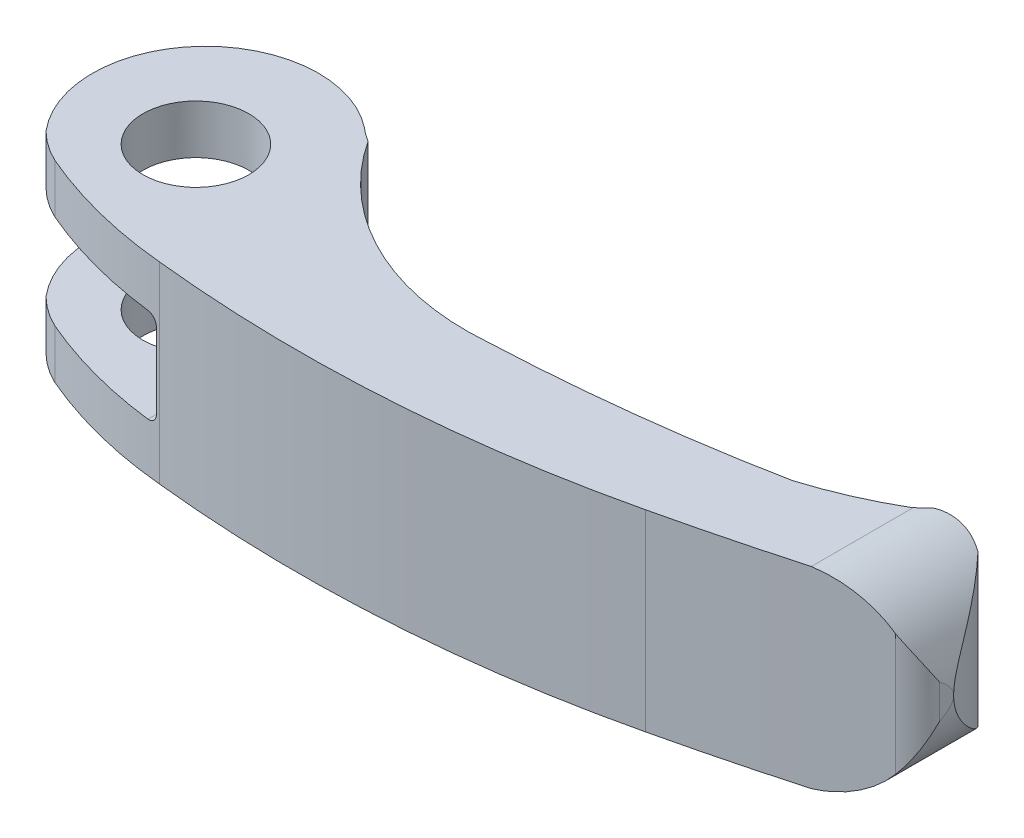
ISO-10303-21;
HEADER;
FILE_DESCRIPTION(('STEP AP214'),'2;1');
FILE_NAME('part.step','',(''),(''),'','','');
FILE_SCHEMA(('AUTOMOTIVE_DESIGN { 1 0 10303 214 1 1 1 1 }'));
ENDSEC;
DATA;
#1=APPLICATION_CONTEXT('core data for automotive mechanical design processes');
#2=APPLICATION_PROTOCOL_DEFINITION('international standard','automotive_design',2000,#1);
#3=PRODUCT_CONTEXT('',#1,'mechanical');
#4=PRODUCT('Part','Part','',(#3));
#5=PRODUCT_RELATED_PRODUCT_CATEGORY('part','',(#4));
#6=PRODUCT_DEFINITION_FORMATION('','',#4);
#7=PRODUCT_DEFINITION_CONTEXT('part definition',#1,'design');
#8=PRODUCT_DEFINITION('design','',#6,#7);
#9=PRODUCT_DEFINITION_SHAPE('','',#8);
#10=(LENGTH_UNIT() NAMED_UNIT(*) SI_UNIT(.MILLI.,.METRE.));
#11=(NAMED_UNIT(*) PLANE_ANGLE_UNIT() SI_UNIT($,.RADIAN.));
#12=(NAMED_UNIT(*) SI_UNIT($,.STERADIAN.) SOLID_ANGLE_UNIT());
#13=UNCERTAINTY_MEASURE_WITH_UNIT(LENGTH_MEASURE(1.E-05),#10,'distance_accuracy_value','');
#14=(GEOMETRIC_REPRESENTATION_CONTEXT(3) GLOBAL_UNCERTAINTY_ASSIGNED_CONTEXT((#13)) GLOBAL_UNIT_ASSIGNED_CONTEXT((#10,
#11,#12)) REPRESENTATION_CONTEXT('',''));
#15=CARTESIAN_POINT('',(0.,0.,0.));
#16=DIRECTION('',(0.,0.,1.));
#17=DIRECTION('',(1.,0.,0.));
#18=AXIS2_PLACEMENT_3D('',#15,#16,#17);
#19=CARTESIAN_POINT('',(-1.25725046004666,-10.,-1.08149572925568));
#20=DIRECTION('',(0.,-1.,0.));
#21=DIRECTION('',(1.,0.,0.));
#22=AXIS2_PLACEMENT_3D('',#19,#20,#21);
#23=PLANE('',#22);
#24=CARTESIAN_POINT('',(24.778083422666,-10.,-187.016828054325));
#25=DIRECTION('',(0.,1.,0.));
#26=DIRECTION('',(1.,0.,0.));
#27=AXIS2_PLACEMENT_3D('',#24,#25,#26);
#28=CIRCLE('',#27,189.839626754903);
#29=CARTESIAN_POINT('',(33.014911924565,-10.,2.6440233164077));
#30=VERTEX_POINT('',#29);
#31=CARTESIAN_POINT('',(61.231882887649,-10.,-0.710079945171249));
#32=VERTEX_POINT('',#31);
#33=EDGE_CURVE('E335',#30,#32,#28,.T.);
#34=ORIENTED_EDGE('',*,*,#33,.T.);
#35=CARTESIAN_POINT('',(49.221459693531,-10.,-40.1661322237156));
#36=DIRECTION('',(0.,1.,0.));
#37=DIRECTION('',(1.,0.,0.));
#38=AXIS2_PLACEMENT_3D('',#35,#36,#37);
#39=CIRCLE('',#38,41.2435489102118);
#40=CARTESIAN_POINT('',(69.968173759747,-10.,-4.52059698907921));
#41=VERTEX_POINT('',#40);
#42=EDGE_CURVE('E337',#32,#41,#39,.T.);
#43=ORIENTED_EDGE('',*,*,#42,.T.);
#44=CARTESIAN_POINT('',(61.6418152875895,-10.,-12.1051867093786));
#45=DIRECTION('',(0.,1.,0.));
#46=DIRECTION('',(1.,0.,0.));
#47=AXIS2_PLACEMENT_3D('',#44,#45,#46);
#48=CIRCLE('',#47,11.2629590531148);
#49=CARTESIAN_POINT('',(70.,-10.,-4.55568374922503));
#50=VERTEX_POINT('',#49);
#51=EDGE_CURVE('E340',#41,#50,#48,.T.);
#52=ORIENTED_EDGE('',*,*,#51,.T.);
#53=DIRECTION('',(0.,0.,-1.));
#54=VECTOR('',#53,1.);
#55=CARTESIAN_POINT('',(70.,-10.,19.75));
#56=LINE('',#55,#54);
#57=CARTESIAN_POINT('',(70.,-10.,6.02646126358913));
#58=VERTEX_POINT('',#57);
#59=EDGE_CURVE('E267',#58,#50,#56,.T.);
#60=ORIENTED_EDGE('',*,*,#59,.F.);
#61=CARTESIAN_POINT('',(-10.9776441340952,-10.,-281.701493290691));
#62=DIRECTION('',(0.,-1.,0.));
#63=DIRECTION('',(1.,0.,0.));
#64=AXIS2_PLACEMENT_3D('',#61,#62,#63);
#65=CIRCLE('',#64,298.905929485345);
#66=CARTESIAN_POINT('',(56.261559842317,-10.,9.54349658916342));
#67=VERTEX_POINT('',#66);
#68=EDGE_CURVE('E343',#58,#67,#65,.T.);
#69=ORIENTED_EDGE('',*,*,#68,.T.);
#70=CARTESIAN_POINT('',(23.8400067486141,-10.,-128.584744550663));
#71=DIRECTION('',(0.,-1.,0.));
#72=DIRECTION('',(1.,0.,0.));
#73=AXIS2_PLACEMENT_3D('',#70,#71,#72);
#74=CIRCLE('',#73,141.882233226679);
#75=CARTESIAN_POINT('',(8.7252072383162,-10.,12.49009708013));
#76=VERTEX_POINT('',#75);
#77=EDGE_CURVE('E345',#67,#76,#74,.T.);
#78=ORIENTED_EDGE('',*,*,#77,.T.);
#79=CARTESIAN_POINT('',(13.0857239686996,-10.,-35.3114289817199));
#80=DIRECTION('',(0.,-1.,0.));
#81=DIRECTION('',(1.,0.,0.));
#82=AXIS2_PLACEMENT_3D('',#79,#80,#81);
#83=CIRCLE('',#82,47.9999999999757);
#84=CARTESIAN_POINT('',(-5.8635593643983,-10.,8.78987101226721));
#85=VERTEX_POINT('',#84);
#86=EDGE_CURVE('E348',#76,#85,#83,.T.);
#87=ORIENTED_EDGE('',*,*,#86,.T.);
#88=CARTESIAN_POINT('',(-1.25725046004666,-10.,-1.08149572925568));
#89=DIRECTION('',(0.,-1.,0.));
#90=DIRECTION('',(1.,0.,0.));
#91=AXIS2_PLACEMENT_3D('',#88,#89,#90);
#92=CIRCLE('',#91,10.8932071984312);
#93=CARTESIAN_POINT('',(-8.9584461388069,-10.,6.6226296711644));
#94=VERTEX_POINT('',#93);
#95=EDGE_CURVE('E327',#85,#94,#92,.T.);
#96=ORIENTED_EDGE('',*,*,#95,.T.);
#97=CARTESIAN_POINT('',(0.000156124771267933,-10.,-0.999995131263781));
#98=DIRECTION('',(0.,-1.,0.));
#99=DIRECTION('',(1.,0.,0.));
#100=AXIS2_PLACEMENT_3D('',#97,#98,#99);
#101=CIRCLE('',#100,11.7626937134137);
#102=CARTESIAN_POINT('',(7.3025628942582,-10.,-10.221481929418));
#103=VERTEX_POINT('',#102);
#104=EDGE_CURVE('E328',#94,#103,#101,.T.);
#105=ORIENTED_EDGE('',*,*,#104,.T.);
#106=CARTESIAN_POINT('',(13.8867058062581,-10.,-17.8022650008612));
#107=DIRECTION('',(0.,1.,0.));
#108=DIRECTION('',(1.,0.,0.));
#109=AXIS2_PLACEMENT_3D('',#106,#107,#108);
#110=CIRCLE('',#109,10.0408769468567);
#111=CARTESIAN_POINT('',(8.68441948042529,-10.,-9.21416702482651));
#112=VERTEX_POINT('',#111);
#113=EDGE_CURVE('E330',#103,#112,#110,.T.);
#114=ORIENTED_EDGE('',*,*,#113,.T.);
#115=CARTESIAN_POINT('',(30.8065587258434,-10.,-23.714505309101));
#116=DIRECTION('',(0.,1.,0.));
#117=DIRECTION('',(1.,0.,0.));
#118=AXIS2_PLACEMENT_3D('',#115,#116,#117);
#119=CIRCLE('',#118,26.4508762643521);
#120=EDGE_CURVE('E333',#112,#30,#119,.T.);
#121=ORIENTED_EDGE('',*,*,#120,.T.);
#122=EDGE_LOOP('',(#34,#43,#52,#60,#69,#78,#87,#96,#105,#114,#121));
#123=FACE_BOUND('',#122,.T.);
#124=CARTESIAN_POINT('',(0.,-10.,0.));
#125=DIRECTION('',(0.,-1.,0.));
#126=DIRECTION('',(1.,0.,0.));
#127=AXIS2_PLACEMENT_3D('',#124,#125,#126);
#128=CIRCLE('',#127,5.5);
#129=CARTESIAN_POINT('',(5.5,-10.,0.));
#130=VERTEX_POINT('',#129);
#131=EDGE_CURVE('E446',#130,#130,#128,.F.);
#132=ORIENTED_EDGE('',*,*,#131,.T.);
#133=EDGE_LOOP('',(#132));
#134=FACE_BOUND('',#133,.T.);
#135=ADVANCED_FACE('F14',(#123,#134),#23,.T.);
#136=CARTESIAN_POINT('',(7.36,-4.9,19.75));
#137=DIRECTION('',(0.,-1.,0.));
#138=DIRECTION('',(1.,0.,0.));
#139=AXIS2_PLACEMENT_3D('',#136,#137,#138);
#140=PLANE('',#139);
#141=CARTESIAN_POINT('',(0.000156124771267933,-4.9,-0.999995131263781));
#142=DIRECTION('',(0.,-1.,0.));
#143=DIRECTION('',(1.,0.,0.));
#144=AXIS2_PLACEMENT_3D('',#141,#142,#143);
#145=CIRCLE('',#144,11.7626937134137);
#146=CARTESIAN_POINT('',(7.30256289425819,-4.9,-10.221481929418));
#147=VERTEX_POINT('',#146);
#148=CARTESIAN_POINT('',(-8.9584461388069,-4.9,6.6226296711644));
#149=VERTEX_POINT('',#148);
#150=EDGE_CURVE('E325',#147,#149,#145,.F.);
#151=ORIENTED_EDGE('',*,*,#150,.T.);
#152=CARTESIAN_POINT('',(-1.25725046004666,-4.9,-1.08149572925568));
#153=DIRECTION('',(0.,-1.,0.));
#154=DIRECTION('',(1.,0.,0.));
#155=AXIS2_PLACEMENT_3D('',#152,#153,#154);
#156=CIRCLE('',#155,10.8932071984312);
#157=CARTESIAN_POINT('',(-5.8635593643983,-4.9,8.7898710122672));
#158=VERTEX_POINT('',#157);
#159=EDGE_CURVE('E323',#149,#158,#156,.F.);
#160=ORIENTED_EDGE('',*,*,#159,.T.);
#161=CARTESIAN_POINT('',(13.0857239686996,-4.9,-35.3114289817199));
#162=DIRECTION('',(0.,-1.,0.));
#163=DIRECTION('',(1.,0.,0.));
#164=AXIS2_PLACEMENT_3D('',#161,#162,#163);
#165=CIRCLE('',#164,47.9999999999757);
#166=CARTESIAN_POINT('',(7.36,-4.9,12.3458483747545));
#167=VERTEX_POINT('',#166);
#168=EDGE_CURVE('E9',#158,#167,#165,.F.);
#169=ORIENTED_EDGE('',*,*,#168,.T.);
#170=DIRECTION('',(0.,0.,-1.));
#171=VECTOR('',#170,1.);
#172=CARTESIAN_POINT('',(7.36,-4.9,19.75));
#173=LINE('',#172,#171);
#174=CARTESIAN_POINT('',(7.36,-4.9,-10.1719752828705));
#175=VERTEX_POINT('',#174);
#176=EDGE_CURVE('E273',#167,#175,#173,.T.);
#177=ORIENTED_EDGE('',*,*,#176,.T.);
#178=CARTESIAN_POINT('',(13.8867058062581,-4.9,-17.8022650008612));
#179=DIRECTION('',(0.,1.,0.));
#180=DIRECTION('',(-1.,0.,0.));
#181=AXIS2_PLACEMENT_3D('',#178,#179,#180);
#182=CIRCLE('',#181,10.0408769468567);
#183=EDGE_CURVE('E222',#147,#175,#182,.T.);
#184=ORIENTED_EDGE('',*,*,#183,.F.);
#185=EDGE_LOOP('',(#151,#160,#169,#177,#184));
#186=FACE_BOUND('',#185,.T.);
#187=CARTESIAN_POINT('',(0.,-4.9,0.));
#188=DIRECTION('',(0.,-1.,0.));
#189=DIRECTION('',(1.,0.,0.));
#190=AXIS2_PLACEMENT_3D('',#187,#188,#189);
#191=CIRCLE('',#190,5.5);
#192=CARTESIAN_POINT('',(5.5,-4.9,0.));
#193=VERTEX_POINT('',#192);
#194=EDGE_CURVE('E18',#193,#193,#191,.F.);
#195=ORIENTED_EDGE('',*,*,#194,.F.);
#196=EDGE_LOOP('',(#195));
#197=FACE_BOUND('',#196,.T.);
#198=ADVANCED_FACE('F438',(#186,#197),#140,.F.);
#199=CARTESIAN_POINT('',(61.2713887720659,10.,6.56919871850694));
#200=DIRECTION('',(0.,-1.,0.));
#201=DIRECTION('',(1.,0.,0.));
#202=AXIS2_PLACEMENT_3D('',#199,#200,#201);
#203=CYLINDRICAL_SURFACE('',#202,18.8265226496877);
#204=DIRECTION('',(0.,-1.,0.));
#205=VECTOR('',#204,1.);
#206=CARTESIAN_POINT('',(75.209294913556,10.,-6.0867377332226));
#207=LINE('',#206,#205);
#208=CARTESIAN_POINT('',(75.209294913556,7.86548448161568,-6.0867377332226));
#209=VERTEX_POINT('',#208);
#210=CARTESIAN_POINT('',(75.209294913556,-7.86548448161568,-6.0867377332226));
#211=VERTEX_POINT('',#210);
#212=EDGE_CURVE('E390',#209,#211,#207,.T.);
#213=ORIENTED_EDGE('',*,*,#212,.F.);
#214=CARTESIAN_POINT('',(75.209294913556,-7.86548448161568,-6.0867377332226));
#215=CARTESIAN_POINT('',(75.3343879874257,-7.76584092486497,-5.9489731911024));
#216=CARTESIAN_POINT('',(75.456518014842,-7.66369469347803,-5.81036775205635));
#217=CARTESIAN_POINT('',(75.6949069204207,-7.45457001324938,-5.53178044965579));
#218=CARTESIAN_POINT('',(75.8111662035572,-7.34759189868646,-5.39179868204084));
#219=CARTESIAN_POINT('',(76.1513076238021,-7.01958843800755,-4.97014128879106));
#220=CARTESIAN_POINT('',(76.3664850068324,-6.79154863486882,-4.68682921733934));
#221=CARTESIAN_POINT('',(76.7763168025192,-6.31474548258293,-4.11538302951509));
#222=CARTESIAN_POINT('',(76.9706958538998,-6.06576741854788,-3.82723170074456));
#223=CARTESIAN_POINT('',(77.3361815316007,-5.54915590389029,-3.2530202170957));
#224=CARTESIAN_POINT('',(77.5072965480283,-5.28152923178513,-2.96695934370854));
#225=CARTESIAN_POINT('',(77.7651966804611,-4.83193684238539,-2.51003469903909));
#226=CARTESIAN_POINT('',(77.8592100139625,-4.65634278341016,-2.33694444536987));
#227=CARTESIAN_POINT('',(78.0381980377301,-4.29631200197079,-1.99521746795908));
#228=CARTESIAN_POINT('',(78.1231711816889,-4.11187377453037,-1.8265815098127));
#229=CARTESIAN_POINT('',(78.2834995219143,-3.73341442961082,-1.49675124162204));
#230=CARTESIAN_POINT('',(78.3588813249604,-3.53942198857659,-1.33553717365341));
#231=CARTESIAN_POINT('',(78.4996408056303,-3.13963519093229,-1.02385535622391));
#232=CARTESIAN_POINT('',(78.5650253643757,-2.93384908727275,-0.873380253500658));
#233=CARTESIAN_POINT('',(78.6864531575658,-2.50186222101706,-0.584725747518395));
#234=CARTESIAN_POINT('',(78.7421743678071,-2.27524501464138,-0.447023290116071));
#235=CARTESIAN_POINT('',(78.8396641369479,-1.80452538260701,-0.19920938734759));
#236=CARTESIAN_POINT('',(78.8814620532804,-1.56046108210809,-0.0890400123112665));
#237=CARTESIAN_POINT('',(78.9402400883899,-1.11220817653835,0.0688017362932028));
#238=CARTESIAN_POINT('',(78.9607017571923,-0.911565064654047,0.124987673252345));
#239=CARTESIAN_POINT('',(78.9894899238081,-0.50297405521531,0.204551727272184));
#240=CARTESIAN_POINT('',(78.9978326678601,-0.295036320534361,0.227973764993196));
#241=CARTESIAN_POINT('',(79.0014298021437,0.122800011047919,0.238032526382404));
#242=CARTESIAN_POINT('',(78.9966247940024,0.332703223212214,0.224502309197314));
#243=CARTESIAN_POINT('',(78.9743994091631,0.746477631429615,0.162771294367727));
#244=CARTESIAN_POINT('',(78.9569805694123,0.950349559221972,0.114574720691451));
#245=CARTESIAN_POINT('',(78.9280233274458,1.20218687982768,0.0360893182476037));
#246=CARTESIAN_POINT('',(78.9215088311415,1.25507304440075,0.0185033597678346));
#247=CARTESIAN_POINT('',(78.8876038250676,1.51355762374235,-0.0725559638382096));
#248=CARTESIAN_POINT('',(78.8548217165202,1.7139547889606,-0.159217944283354));
#249=CARTESIAN_POINT('',(78.7796222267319,2.1030920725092,-0.352541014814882));
#250=CARTESIAN_POINT('',(78.7371804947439,2.29180117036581,-0.459252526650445));
#251=CARTESIAN_POINT('',(78.6435678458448,2.66039107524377,-0.687573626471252));
#252=CARTESIAN_POINT('',(78.592311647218,2.84016113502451,-0.809325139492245));
#253=CARTESIAN_POINT('',(78.4823180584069,3.1901074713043,-1.06237424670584));
#254=CARTESIAN_POINT('',(78.4235865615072,3.36029115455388,-1.19366428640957));
#255=CARTESIAN_POINT('',(78.3023668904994,3.68398843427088,-1.45598317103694));
#256=CARTESIAN_POINT('',(78.2402293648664,3.83790904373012,-1.58667534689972));
#257=CARTESIAN_POINT('',(78.1099518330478,4.13940105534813,-1.85236002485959));
#258=CARTESIAN_POINT('',(78.0418105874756,4.28697113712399,-1.9873534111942));
#259=CARTESIAN_POINT('',(77.899641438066,4.57653574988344,-2.2604610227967));
#260=CARTESIAN_POINT('',(77.8256084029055,4.71852525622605,-2.39857789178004));
#261=CARTESIAN_POINT('',(77.6717964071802,4.99728439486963,-2.676875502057));
#262=CARTESIAN_POINT('',(77.5920168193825,5.13405345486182,-2.81705646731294));
#263=CARTESIAN_POINT('',(77.3448353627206,5.53591867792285,-3.23834237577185));
#264=CARTESIAN_POINT('',(77.1689677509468,5.79383242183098,-3.52139911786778));
#265=CARTESIAN_POINT('',(76.7947719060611,6.29152909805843,-4.08809394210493));
#266=CARTESIAN_POINT('',(76.5964593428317,6.53132448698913,-4.37173148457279));
#267=CARTESIAN_POINT('',(76.2072482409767,6.95967313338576,-4.89590850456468));
#268=CARTESIAN_POINT('',(76.0194132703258,7.15062603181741,-5.13675784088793));
#269=CARTESIAN_POINT('',(75.7250644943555,7.4266715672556,-5.49534059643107));
#270=CARTESIAN_POINT('',(75.6249008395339,7.51691456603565,-5.61436216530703));
#271=CARTESIAN_POINT('',(75.4203063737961,7.69387365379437,-5.85137263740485));
#272=CARTESIAN_POINT('',(75.3158752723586,7.78058950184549,-5.96936146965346));
#273=CARTESIAN_POINT('',(75.209294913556,7.86548448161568,-6.0867377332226));
#274=B_SPLINE_CURVE_WITH_KNOTS('',3,(#214,#215,#216,#217,#218,#219,#220,#221,#222,#223,#224,
#225,#226,#227,#228,#229,#230,#231,#232,#233,#234,#235,#236,#237,#238,#239,#240,#241,#242,#243,
#244,#245,#246,#247,#248,#249,#250,#251,#252,#253,#254,#255,#256,#257,#258,#259,#260,#261,#262,
#263,#264,#265,#266,#267,#268,#269,#270,#271,#272,#273),.UNSPECIFIED.,.F.,.F.,(4,2,2,2,2,2,2,2,
2,2,2,2,2,2,2,2,2,2,2,2,2,2,2,2,2,2,2,2,2,4),(0.,0.633165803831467,1.26628787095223,
2.53287818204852,3.81457383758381,5.09580602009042,5.88716582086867,6.67866076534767,
7.4679098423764,8.25661320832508,9.06795667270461,9.87757841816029,10.5031778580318,
11.1279378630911,11.7555250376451,12.383035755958,12.5513700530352,13.2114478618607,
13.8732084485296,14.5417745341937,15.2098167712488,15.8433589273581,16.4770321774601,
17.1112634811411,17.7455641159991,19.0086178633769,20.2707951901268,21.3507377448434,
21.8901823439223,22.4296637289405),.UNSPECIFIED.);
#275=CARTESIAN_POINT('',(79.,0.,0.234035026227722));
#276=VERTEX_POINT('',#275);
#277=EDGE_CURVE('E308',#276,#209,#274,.T.);
#278=ORIENTED_EDGE('',*,*,#277,.F.);
#279=EDGE_CURVE('E321',#211,#276,#274,.T.);
#280=ORIENTED_EDGE('',*,*,#279,.F.);
#281=EDGE_LOOP('',(#213,#278,#280));
#282=FACE_BOUND('',#281,.T.);
#283=ADVANCED_FACE('F247',(#282),#203,.T.);
#284=CARTESIAN_POINT('',(0.000156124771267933,10.,-0.999995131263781));
#285=DIRECTION('',(0.,-1.,0.));
#286=DIRECTION('',(1.,0.,0.));
#287=AXIS2_PLACEMENT_3D('',#284,#285,#286);
#288=CYLINDRICAL_SURFACE('',#287,11.7626937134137);
#289=ORIENTED_EDGE('',*,*,#150,.F.);
#290=DIRECTION('',(0.,-1.,0.));
#291=VECTOR('',#290,1.);
#292=CARTESIAN_POINT('',(7.3025628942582,10.,-10.221481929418));
#293=LINE('',#292,#291);
#294=EDGE_CURVE('E406',#147,#103,#293,.T.);
#295=ORIENTED_EDGE('',*,*,#294,.T.);
#296=ORIENTED_EDGE('',*,*,#104,.F.);
#297=DIRECTION('',(0.,-1.,0.));
#298=VECTOR('',#297,1.);
#299=CARTESIAN_POINT('',(-8.9584461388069,10.,6.6226296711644));
#300=LINE('',#299,#298);
#301=EDGE_CURVE('E409',#149,#94,#300,.T.);
#302=ORIENTED_EDGE('',*,*,#301,.F.);
#303=EDGE_LOOP('',(#289,#295,#296,#302));
#304=FACE_BOUND('',#303,.T.);
#305=ADVANCED_FACE('F467',(#304),#288,.T.);
#306=CARTESIAN_POINT('',(7.3025628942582,10.,-10.221481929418));
#307=VERTEX_POINT('',#306);
#308=CARTESIAN_POINT('',(7.30256289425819,4.9,-10.221481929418));
#309=VERTEX_POINT('',#308);
#310=EDGE_CURVE('E407',#307,#309,#293,.T.);
#311=ORIENTED_EDGE('',*,*,#310,.T.);
#312=CARTESIAN_POINT('',(0.000156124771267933,4.9,-0.999995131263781));
#313=DIRECTION('',(0.,1.,0.));
#314=DIRECTION('',(-1.,0.,0.));
#315=AXIS2_PLACEMENT_3D('',#312,#313,#314);
#316=CIRCLE('',#315,11.7626937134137);
#317=CARTESIAN_POINT('',(-8.9584461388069,4.9,6.6226296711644));
#318=VERTEX_POINT('',#317);
#319=EDGE_CURVE('E183',#318,#309,#316,.F.);
#320=ORIENTED_EDGE('',*,*,#319,.F.);
#321=CARTESIAN_POINT('',(-8.9584461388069,10.,6.6226296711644));
#322=VERTEX_POINT('',#321);
#323=EDGE_CURVE('E410',#322,#318,#300,.T.);
#324=ORIENTED_EDGE('',*,*,#323,.F.);
#325=CARTESIAN_POINT('',(0.000156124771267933,10.,-0.999995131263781));
#326=DIRECTION('',(0.,-1.,0.));
#327=DIRECTION('',(1.,0.,0.));
#328=AXIS2_PLACEMENT_3D('',#325,#326,#327);
#329=CIRCLE('',#328,11.7626937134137);
#330=EDGE_CURVE('E354',#322,#307,#329,.T.);
#331=ORIENTED_EDGE('',*,*,#330,.T.);
#332=EDGE_LOOP('',(#311,#320,#324,#331));
#333=FACE_BOUND('',#332,.T.);
#334=ADVANCED_FACE('F555',(#333),#288,.T.);
#335=CARTESIAN_POINT('',(13.8867058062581,10.,-17.8022650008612));
#336=DIRECTION('',(0.,-1.,0.));
#337=DIRECTION('',(1.,0.,0.));
#338=AXIS2_PLACEMENT_3D('',#335,#336,#337);
#339=CYLINDRICAL_SURFACE('',#338,10.0408769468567);
#340=ORIENTED_EDGE('',*,*,#294,.F.);
#341=ORIENTED_EDGE('',*,*,#183,.T.);
#342=CARTESIAN_POINT('',(7.36,-4.9,-10.1719752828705));
#343=CARTESIAN_POINT('',(7.39206769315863,-4.89999320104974,-10.1445446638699));
#344=CARTESIAN_POINT('',(7.42429718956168,-4.89845630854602,-10.1173282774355));
#345=CARTESIAN_POINT('',(7.48894748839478,-4.89218592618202,-10.0634231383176));
#346=CARTESIAN_POINT('',(7.52136846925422,-4.88744873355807,-10.0367350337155));
#347=CARTESIAN_POINT('',(7.61900355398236,-4.86815843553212,-9.95738511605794));
#348=CARTESIAN_POINT('',(7.68419309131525,-4.84852314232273,-9.90577673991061));
#349=CARTESIAN_POINT('',(7.79965313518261,-4.79991254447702,-9.8165729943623));
#350=CARTESIAN_POINT('',(7.85038360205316,-4.77345660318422,-9.77819039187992));
#351=CARTESIAN_POINT('',(7.94834187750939,-4.71069048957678,-9.70542984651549));
#352=CARTESIAN_POINT('',(7.99558029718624,-4.67441187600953,-9.67103957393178));
#353=CARTESIAN_POINT('',(8.07705911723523,-4.59883937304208,-9.61268013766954));
#354=CARTESIAN_POINT('',(8.11215110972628,-4.56106968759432,-9.58793039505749));
#355=CARTESIAN_POINT('',(8.17706058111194,-4.47892009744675,-9.5426810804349));
#356=CARTESIAN_POINT('',(8.20687658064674,-4.43453834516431,-9.52218270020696));
#357=CARTESIAN_POINT('',(8.25983183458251,-4.33963303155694,-9.48610367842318));
#358=CARTESIAN_POINT('',(8.28292101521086,-4.289067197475,-9.47055984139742));
#359=CARTESIAN_POINT('',(8.32059201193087,-4.18352385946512,-9.44534514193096));
#360=CARTESIAN_POINT('',(8.33519012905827,-4.12855504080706,-9.43566302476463));
#361=CARTESIAN_POINT('',(8.34998423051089,-4.04410128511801,-9.42587219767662));
#362=CARTESIAN_POINT('',(8.35373238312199,-4.01546008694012,-9.42339700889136));
#363=CARTESIAN_POINT('',(8.35874123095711,-3.95788608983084,-9.42009215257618));
#364=CARTESIAN_POINT('',(8.36000353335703,-3.92895349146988,-9.41926142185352));
#365=CARTESIAN_POINT('',(8.36,-3.9,-9.41926238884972));
#366=B_SPLINE_CURVE_WITH_KNOTS('',3,(#342,#343,#344,#345,#346,#347,#348,#349,#350,#351,#352,
#353,#354,#355,#356,#357,#358,#359,#360,#361,#362,#363,#364,#365),.UNSPECIFIED.,.F.,.F.,(4,2,2,
2,2,2,2,2,2,2,2,4),(0.,0.126530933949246,0.25320851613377,0.508112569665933,0.714041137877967,
0.919315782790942,1.090189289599,1.26111063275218,1.43327356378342,1.60510487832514,
1.69194193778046,1.77872283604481),.UNSPECIFIED.);
#367=CARTESIAN_POINT('',(8.36,-3.9,-9.41926238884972));
#368=VERTEX_POINT('',#367);
#369=EDGE_CURVE('E195',#175,#368,#366,.T.);
#370=ORIENTED_EDGE('',*,*,#369,.T.);
#371=DIRECTION('',(0.,-1.,0.));
#372=VECTOR('',#371,1.);
#373=CARTESIAN_POINT('',(8.36,10.,-9.41926238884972));
#374=LINE('',#373,#372);
#375=CARTESIAN_POINT('',(8.36,3.89999999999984,-9.41926238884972));
#376=VERTEX_POINT('',#375);
#377=EDGE_CURVE('E193',#368,#376,#374,.F.);
#378=ORIENTED_EDGE('',*,*,#377,.T.);
#379=CARTESIAN_POINT('',(8.36,3.89999999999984,-9.41926238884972));
#380=CARTESIAN_POINT('',(8.36000175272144,3.92464032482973,-9.41926193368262));
#381=CARTESIAN_POINT('',(8.35908854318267,3.94926765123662,-9.41986322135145));
#382=CARTESIAN_POINT('',(8.35545831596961,3.99832241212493,-9.42225794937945));
#383=CARTESIAN_POINT('',(8.35274191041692,4.02274991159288,-9.42405098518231));
#384=CARTESIAN_POINT('',(8.34196477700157,4.09523704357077,-9.4311757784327));
#385=CARTESIAN_POINT('',(8.33127549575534,4.14276904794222,-9.43825352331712));
#386=CARTESIAN_POINT('',(8.3034763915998,4.23492049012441,-9.4567851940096));
#387=CARTESIAN_POINT('',(8.28637218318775,4.27954243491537,-9.46823529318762));
#388=CARTESIAN_POINT('',(8.24658516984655,4.36496075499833,-9.49511003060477));
#389=CARTESIAN_POINT('',(8.22389773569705,4.40575391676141,-9.51053796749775));
#390=CARTESIAN_POINT('',(8.17263770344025,4.48476644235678,-9.54577369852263));
#391=CARTESIAN_POINT('',(8.14382157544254,4.52274388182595,-9.56576662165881));
#392=CARTESIAN_POINT('',(8.08225325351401,4.59321151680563,-9.60903871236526));
#393=CARTESIAN_POINT('',(8.04949981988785,4.62569997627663,-9.63231891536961));
#394=CARTESIAN_POINT('',(7.97591072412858,4.68953938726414,-9.68536517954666));
#395=CARTESIAN_POINT('',(7.93460262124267,4.71997082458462,-9.71557943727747));
#396=CARTESIAN_POINT('',(7.84950566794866,4.77344984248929,-9.77890881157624));
#397=CARTESIAN_POINT('',(7.80571475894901,4.7964911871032,-9.81202634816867));
#398=CARTESIAN_POINT('',(7.70809085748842,4.8392544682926,-9.88718951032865));
#399=CARTESIAN_POINT('',(7.65396424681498,4.85745395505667,-9.92971713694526));
#400=CARTESIAN_POINT('',(7.54525412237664,4.88428489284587,-10.0170191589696));
#401=CARTESIAN_POINT('',(7.4906708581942,4.89292126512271,-10.0617923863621));
#402=CARTESIAN_POINT('',(7.41084261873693,4.89903439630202,-10.1287039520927));
#403=CARTESIAN_POINT('',(7.38535862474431,4.89999822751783,-10.1502812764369));
#404=CARTESIAN_POINT('',(7.36,4.9,-10.1719752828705));
#405=B_SPLINE_CURVE_WITH_KNOTS('',3,(#379,#380,#381,#382,#383,#384,#385,#386,#387,#388,#389,
#390,#391,#392,#393,#394,#395,#396,#397,#398,#399,#400,#401,#402,#403,#404),.UNSPECIFIED.,.F.,
.F.,(4,2,2,2,2,2,2,2,2,2,2,2,4),(0.,0.0738714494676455,0.1477178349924,0.294618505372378,
0.44139090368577,0.588285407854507,0.742770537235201,0.897304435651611,1.07527129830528,
1.25338794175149,1.46622311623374,1.67894871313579,1.77909531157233),.UNSPECIFIED.);
#406=CARTESIAN_POINT('',(7.36,4.9,-10.1719752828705));
#407=VERTEX_POINT('',#406);
#408=EDGE_CURVE('E171',#376,#407,#405,.T.);
#409=ORIENTED_EDGE('',*,*,#408,.T.);
#410=CARTESIAN_POINT('',(13.8867058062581,4.9,-17.8022650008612));
#411=DIRECTION('',(0.,-1.,0.));
#412=DIRECTION('',(1.,0.,0.));
#413=AXIS2_PLACEMENT_3D('',#410,#411,#412);
#414=CIRCLE('',#413,10.0408769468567);
#415=EDGE_CURVE('E180',#407,#309,#414,.T.);
#416=ORIENTED_EDGE('',*,*,#415,.T.);
#417=ORIENTED_EDGE('',*,*,#310,.F.);
#418=CARTESIAN_POINT('',(13.8867058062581,10.,-17.8022650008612));
#419=DIRECTION('',(0.,1.,0.));
#420=DIRECTION('',(1.,0.,0.));
#421=AXIS2_PLACEMENT_3D('',#418,#419,#420);
#422=CIRCLE('',#421,10.0408769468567);
#423=CARTESIAN_POINT('',(8.68441948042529,10.,-9.21416702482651));
#424=VERTEX_POINT('',#423);
#425=EDGE_CURVE('E356',#307,#424,#422,.T.);
#426=ORIENTED_EDGE('',*,*,#425,.T.);
#427=DIRECTION('',(0.,-1.,0.));
#428=VECTOR('',#427,1.);
#429=CARTESIAN_POINT('',(8.68441948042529,10.,-9.21416702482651));
#430=LINE('',#429,#428);
#431=EDGE_CURVE('E404',#424,#112,#430,.T.);
#432=ORIENTED_EDGE('',*,*,#431,.T.);
#433=ORIENTED_EDGE('',*,*,#113,.F.);
#434=EDGE_LOOP('',(#340,#341,#370,#378,#409,#416,#417,#426,#432,#433));
#435=FACE_BOUND('',#434,.T.);
#436=ADVANCED_FACE('F190',(#435),#339,.F.);
#437=CARTESIAN_POINT('',(61.6418152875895,10.,-12.1051867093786));
#438=DIRECTION('',(0.,-1.,0.));
#439=DIRECTION('',(1.,0.,0.));
#440=AXIS2_PLACEMENT_3D('',#437,#438,#439);
#441=CYLINDRICAL_SURFACE('',#440,11.2629590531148);
#442=CARTESIAN_POINT('',(61.6418152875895,10.,-12.1051867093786));
#443=DIRECTION('',(0.,1.,0.));
#444=DIRECTION('',(1.,0.,0.));
#445=AXIS2_PLACEMENT_3D('',#442,#443,#444);
#446=CIRCLE('',#445,11.2629590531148);
#447=CARTESIAN_POINT('',(69.968173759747,10.,-4.52059698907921));
#448=VERTEX_POINT('',#447);
#449=CARTESIAN_POINT('',(70.,10.,-4.55568374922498));
#450=VERTEX_POINT('',#449);
#451=EDGE_CURVE('E366',#448,#450,#446,.T.);
#452=ORIENTED_EDGE('',*,*,#451,.T.);
#453=CARTESIAN_POINT('',(70.,10.,-4.55568374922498));
#454=CARTESIAN_POINT('',(70.0794606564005,9.99161232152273,-4.64365508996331));
#455=CARTESIAN_POINT('',(70.1574913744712,9.9824182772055,-4.73283729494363));
#456=CARTESIAN_POINT('',(70.3105436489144,9.96262610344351,-4.9134285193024));
#457=CARTESIAN_POINT('',(70.3855683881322,9.95202951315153,-5.00483500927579));
#458=CARTESIAN_POINT('',(70.5326319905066,9.92962187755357,-5.18987094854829));
#459=CARTESIAN_POINT('',(70.6046708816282,9.91781084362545,-5.28350037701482));
#460=CARTESIAN_POINT('',(70.7457841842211,9.89315454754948,-5.4729948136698));
#461=CARTESIAN_POINT('',(70.8148552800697,9.8803081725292,-5.5688621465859));
#462=CARTESIAN_POINT('',(70.882374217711,9.86704746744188,-5.6657521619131));
#463=B_SPLINE_CURVE_WITH_KNOTS('',3,(#453,#454,#455,#456,#457,#458,#459,#460,#461,#462),
.UNSPECIFIED.,.F.,.F.,(4,2,2,2,4),(0.,0.35650298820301,0.712617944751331,1.06872956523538,
1.42522920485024),.UNSPECIFIED.);
#464=CARTESIAN_POINT('',(70.882374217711,9.86704746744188,-5.6657521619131));
#465=VERTEX_POINT('',#464);
#466=EDGE_CURVE('E233',#450,#465,#463,.T.);
#467=ORIENTED_EDGE('',*,*,#466,.T.);
#468=DIRECTION('',(0.,-1.,0.));
#469=VECTOR('',#468,1.);
#470=CARTESIAN_POINT('',(70.882374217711,10.,-5.66575216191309));
#471=LINE('',#470,#469);
#472=CARTESIAN_POINT('',(70.882374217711,-9.86704746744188,-5.6657521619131));
#473=VERTEX_POINT('',#472);
#474=EDGE_CURVE('E393',#465,#473,#471,.T.);
#475=ORIENTED_EDGE('',*,*,#474,.T.);
#476=CARTESIAN_POINT('',(70.882374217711,-9.86704746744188,-5.6657521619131));
#477=CARTESIAN_POINT('',(70.8148552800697,-9.8803081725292,-5.56886214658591));
#478=CARTESIAN_POINT('',(70.7457841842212,-9.89315454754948,-5.47299481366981));
#479=CARTESIAN_POINT('',(70.6046708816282,-9.91781084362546,-5.28350037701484));
#480=CARTESIAN_POINT('',(70.5326319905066,-9.92962187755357,-5.1898709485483));
#481=CARTESIAN_POINT('',(70.3855683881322,-9.95202951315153,-5.0048350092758));
#482=CARTESIAN_POINT('',(70.3105436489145,-9.96262610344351,-4.91342851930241));
#483=CARTESIAN_POINT('',(70.1574913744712,-9.9824182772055,-4.73283729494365));
#484=CARTESIAN_POINT('',(70.0794606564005,-9.99161232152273,-4.64365508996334));
#485=CARTESIAN_POINT('',(70.,-10.,-4.55568374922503));
#486=B_SPLINE_CURVE_WITH_KNOTS('',3,(#476,#477,#478,#479,#480,#481,#482,#483,#484,#485),
.UNSPECIFIED.,.F.,.F.,(4,2,2,2,4),(0.,0.356499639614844,0.712611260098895,1.06872621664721,
1.4252292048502),.UNSPECIFIED.);
#487=EDGE_CURVE('E260',#473,#50,#486,.T.);
#488=ORIENTED_EDGE('',*,*,#487,.T.);
#489=ORIENTED_EDGE('',*,*,#51,.F.);
#490=DIRECTION('',(0.,-1.,0.));
#491=VECTOR('',#490,1.);
#492=CARTESIAN_POINT('',(69.968173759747,10.,-4.52059698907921));
#493=LINE('',#492,#491);
#494=EDGE_CURVE('E396',#448,#41,#493,.T.);
#495=ORIENTED_EDGE('',*,*,#494,.F.);
#496=EDGE_LOOP('',(#452,#467,#475,#488,#489,#495));
#497=FACE_BOUND('',#496,.T.);
#498=ADVANCED_FACE('F245',(#497),#441,.F.);
#499=CARTESIAN_POINT('',(73.3760413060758,10.,-2.48235575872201));
#500=DIRECTION('',(0.,-1.,0.));
#501=DIRECTION('',(1.,0.,0.));
#502=AXIS2_PLACEMENT_3D('',#499,#500,#501);
#503=CYLINDRICAL_SURFACE('',#502,4.04380862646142);
#504=ORIENTED_EDGE('',*,*,#212,.T.);
#505=CARTESIAN_POINT('',(75.209294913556,-7.86548448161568,-6.0867377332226));
#506=CARTESIAN_POINT('',(75.0842788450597,-7.96509888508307,-6.15030895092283));
#507=CARTESIAN_POINT('',(74.9549147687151,-8.06322643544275,-6.20793010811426));
#508=CARTESIAN_POINT('',(74.6878734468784,-8.25555538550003,-6.310149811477));
#509=CARTESIAN_POINT('',(74.5501774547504,-8.34974705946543,-6.35471756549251));
#510=CARTESIAN_POINT('',(74.2668087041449,-8.53318755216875,-6.42956724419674));
#511=CARTESIAN_POINT('',(74.1211027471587,-8.62241214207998,-6.4597837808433));
#512=CARTESIAN_POINT('',(73.8235824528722,-8.79418197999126,-6.50413094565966));
#513=CARTESIAN_POINT('',(73.6717751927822,-8.8767346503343,-6.51827968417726));
#514=CARTESIAN_POINT('',(73.4127918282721,-9.00899450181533,-6.527361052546));
#515=CARTESIAN_POINT('',(73.3068222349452,-9.06078034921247,-6.52698300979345));
#516=CARTESIAN_POINT('',(73.0934400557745,-9.16045212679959,-6.51768985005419));
#517=CARTESIAN_POINT('',(72.9860278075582,-9.20833895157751,-6.50877669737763));
#518=CARTESIAN_POINT('',(72.7708050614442,-9.29982810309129,-6.48208152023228));
#519=CARTESIAN_POINT('',(72.6629962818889,-9.34344106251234,-6.46432221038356));
#520=CARTESIAN_POINT('',(72.4475962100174,-9.42631618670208,-6.41967355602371));
#521=CARTESIAN_POINT('',(72.3400048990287,-9.46557874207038,-6.39278503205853));
#522=CARTESIAN_POINT('',(72.1331011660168,-9.53718237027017,-6.33181521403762));
#523=CARTESIAN_POINT('',(72.033712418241,-9.56980964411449,-6.29832832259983));
#524=CARTESIAN_POINT('',(71.8368111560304,-9.63114961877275,-6.22324566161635));
#525=CARTESIAN_POINT('',(71.7392984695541,-9.65986268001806,-6.18165063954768));
#526=CARTESIAN_POINT('',(71.5470962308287,-9.71341069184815,-6.09049272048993));
#527=CARTESIAN_POINT('',(71.4524040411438,-9.73824936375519,-6.04093756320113));
#528=CARTESIAN_POINT('',(71.2666251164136,-9.78421295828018,-5.93405445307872));
#529=CARTESIAN_POINT('',(71.1755363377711,-9.80534000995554,-5.87673098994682));
#530=CARTESIAN_POINT('',(71.0518877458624,-9.83230136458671,-5.79180902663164));
#531=CARTESIAN_POINT('',(71.0174538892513,-9.83961591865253,-5.76735826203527));
#532=CARTESIAN_POINT('',(70.949347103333,-9.85371856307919,-5.71737109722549));
#533=CARTESIAN_POINT('',(70.915673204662,-9.86050735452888,-5.69183621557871));
#534=CARTESIAN_POINT('',(70.882374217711,-9.86704746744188,-5.6657521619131));
#535=B_SPLINE_CURVE_WITH_KNOTS('',3,(#505,#506,#507,#508,#509,#510,#511,#512,#513,#514,#515,
#516,#517,#518,#519,#520,#521,#522,#523,#524,#525,#526,#527,#528,#529,#530,#531,#532,#533,#534),
.UNSPECIFIED.,.F.,.F.,(4,2,2,2,2,2,2,2,2,2,2,2,2,2,4),(0.,0.516070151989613,1.03334805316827,
1.55296072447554,2.07198714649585,2.42548598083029,2.77890347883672,3.13141813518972,
3.48390111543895,3.8130364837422,4.14214152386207,4.47092848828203,4.79952623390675,
4.92808948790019,5.05647824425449),.UNSPECIFIED.);
#536=EDGE_CURVE('E253',#211,#473,#535,.T.);
#537=ORIENTED_EDGE('',*,*,#536,.T.);
#538=ORIENTED_EDGE('',*,*,#474,.F.);
#539=CARTESIAN_POINT('',(70.882374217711,9.86704746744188,-5.6657521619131));
#540=CARTESIAN_POINT('',(70.9689067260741,9.8500626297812,-5.73356147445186));
#541=CARTESIAN_POINT('',(71.0580175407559,9.83136880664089,-5.79764625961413));
#542=CARTESIAN_POINT('',(71.2405292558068,9.79034639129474,-5.91803345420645));
#543=CARTESIAN_POINT('',(71.333929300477,9.76801852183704,-5.97433740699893));
#544=CARTESIAN_POINT('',(71.5238199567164,9.71959849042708,-6.07865462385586));
#545=CARTESIAN_POINT('',(71.6202972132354,9.69352122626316,-6.12669912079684));
#546=CARTESIAN_POINT('',(71.8158017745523,9.63741900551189,-6.21458378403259));
#547=CARTESIAN_POINT('',(71.9148290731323,9.60739405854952,-6.25442397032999));
#548=CARTESIAN_POINT('',(72.1145282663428,9.54336147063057,-6.32581904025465));
#549=CARTESIAN_POINT('',(72.2151995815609,9.50935520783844,-6.35737677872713));
#550=CARTESIAN_POINT('',(72.4173809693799,9.43739683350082,-6.41228597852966));
#551=CARTESIAN_POINT('',(72.5188913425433,9.39944324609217,-6.43563435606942));
#552=CARTESIAN_POINT('',(72.8234389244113,9.27981465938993,-6.49354365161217));
#553=CARTESIAN_POINT('',(73.0266246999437,9.19232995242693,-6.51601493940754));
#554=CARTESIAN_POINT('',(73.4364815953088,8.99941811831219,-6.53115518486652));
#555=CARTESIAN_POINT('',(73.6428952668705,8.89335881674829,-6.52243144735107));
#556=CARTESIAN_POINT('',(74.0454838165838,8.66872483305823,-6.47551738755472));
#557=CARTESIAN_POINT('',(74.2416477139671,8.55013712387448,-6.43729612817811));
#558=CARTESIAN_POINT('',(74.5684794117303,8.33734798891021,-6.34898012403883));
#559=CARTESIAN_POINT('',(74.702344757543,8.24538827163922,-6.3050247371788));
#560=CARTESIAN_POINT('',(74.9619059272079,8.05791337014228,-6.2048064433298));
#561=CARTESIAN_POINT('',(75.0876322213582,7.96241383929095,-6.14859335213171));
#562=CARTESIAN_POINT('',(75.209294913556,7.86548448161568,-6.08673773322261));
#563=B_SPLINE_CURVE_WITH_KNOTS('',3,(#539,#540,#541,#542,#543,#544,#545,#546,#547,#548,#549,
#550,#551,#552,#553,#554,#555,#556,#557,#558,#559,#560,#561,#562),.UNSPECIFIED.,.F.,.F.,(4,2,2,
2,2,2,2,2,2,2,2,4),(0.,0.333612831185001,0.667159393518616,0.999415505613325,1.33167080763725,
1.66381143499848,1.99607669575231,2.6601741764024,3.3542830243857,4.04912084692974,
4.55322347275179,5.05531437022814),.UNSPECIFIED.);
#564=EDGE_CURVE('E225',#465,#209,#563,.T.);
#565=ORIENTED_EDGE('',*,*,#564,.T.);
#566=EDGE_LOOP('',(#504,#537,#538,#565));
#567=FACE_BOUND('',#566,.T.);
#568=ADVANCED_FACE('F240',(#567),#503,.T.);
#569=CARTESIAN_POINT('',(-1.25725046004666,10.,-1.08149572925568));
#570=DIRECTION('',(0.,-1.,0.));
#571=DIRECTION('',(1.,0.,0.));
#572=AXIS2_PLACEMENT_3D('',#569,#570,#571);
#573=CYLINDRICAL_SURFACE('',#572,10.8932071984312);
#574=ORIENTED_EDGE('',*,*,#159,.F.);
#575=ORIENTED_EDGE('',*,*,#301,.T.);
#576=ORIENTED_EDGE('',*,*,#95,.F.);
#577=DIRECTION('',(0.,-1.,0.));
#578=VECTOR('',#577,1.);
#579=CARTESIAN_POINT('',(-5.8635593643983,10.,8.78987101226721));
#580=LINE('',#579,#578);
#581=EDGE_CURVE('E376',#158,#85,#580,.T.);
#582=ORIENTED_EDGE('',*,*,#581,.F.);
#583=EDGE_LOOP('',(#574,#575,#576,#582));
#584=FACE_BOUND('',#583,.T.);
#585=ADVANCED_FACE('F244',(#584),#573,.T.);
#586=CARTESIAN_POINT('',(-1.25725046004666,4.9,-1.08149572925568));
#587=DIRECTION('',(0.,1.,0.));
#588=DIRECTION('',(-1.,0.,0.));
#589=AXIS2_PLACEMENT_3D('',#586,#587,#588);
#590=CIRCLE('',#589,10.8932071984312);
#591=CARTESIAN_POINT('',(-5.8635593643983,4.9,8.7898710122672));
#592=VERTEX_POINT('',#591);
#593=EDGE_CURVE('E319',#592,#318,#590,.F.);
#594=ORIENTED_EDGE('',*,*,#593,.F.);
#595=CARTESIAN_POINT('',(-5.8635593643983,10.,8.78987101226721));
#596=VERTEX_POINT('',#595);
#597=EDGE_CURVE('E39',#596,#592,#580,.T.);
#598=ORIENTED_EDGE('',*,*,#597,.F.);
#599=CARTESIAN_POINT('',(-1.25725046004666,10.,-1.08149572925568));
#600=DIRECTION('',(0.,-1.,0.));
#601=DIRECTION('',(1.,0.,0.));
#602=AXIS2_PLACEMENT_3D('',#599,#600,#601);
#603=CIRCLE('',#602,10.8932071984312);
#604=EDGE_CURVE('E351',#596,#322,#603,.T.);
#605=ORIENTED_EDGE('',*,*,#604,.T.);
#606=ORIENTED_EDGE('',*,*,#323,.T.);
#607=EDGE_LOOP('',(#594,#598,#605,#606));
#608=FACE_BOUND('',#607,.T.);
#609=ADVANCED_FACE('F16',(#608),#573,.T.);
#610=CARTESIAN_POINT('',(30.8065587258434,10.,-23.714505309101));
#611=DIRECTION('',(0.,-1.,0.));
#612=DIRECTION('',(1.,0.,0.));
#613=AXIS2_PLACEMENT_3D('',#610,#611,#612);
#614=CYLINDRICAL_SURFACE('',#613,26.4508762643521);
#615=DIRECTION('',(0.,-1.,0.));
#616=VECTOR('',#615,1.);
#617=CARTESIAN_POINT('',(33.014911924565,10.,2.6440233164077));
#618=LINE('',#617,#616);
#619=CARTESIAN_POINT('',(33.014911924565,10.,2.6440233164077));
#620=VERTEX_POINT('',#619);
#621=EDGE_CURVE('E401',#620,#30,#618,.T.);
#622=ORIENTED_EDGE('',*,*,#621,.T.);
#623=ORIENTED_EDGE('',*,*,#120,.F.);
#624=ORIENTED_EDGE('',*,*,#431,.F.);
#625=CARTESIAN_POINT('',(30.8065587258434,10.,-23.714505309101));
#626=DIRECTION('',(0.,1.,0.));
#627=DIRECTION('',(1.,0.,0.));
#628=AXIS2_PLACEMENT_3D('',#625,#626,#627);
#629=CIRCLE('',#628,26.4508762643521);
#630=EDGE_CURVE('E359',#424,#620,#629,.T.);
#631=ORIENTED_EDGE('',*,*,#630,.T.);
#632=EDGE_LOOP('',(#622,#623,#624,#631));
#633=FACE_BOUND('',#632,.T.);
#634=ADVANCED_FACE('F491',(#633),#614,.F.);
#635=CARTESIAN_POINT('',(24.778083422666,10.,-187.016828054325));
#636=DIRECTION('',(0.,-1.,0.));
#637=DIRECTION('',(1.,0.,0.));
#638=AXIS2_PLACEMENT_3D('',#635,#636,#637);
#639=CYLINDRICAL_SURFACE('',#638,189.839626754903);
#640=DIRECTION('',(0.,-1.,0.));
#641=VECTOR('',#640,1.);
#642=CARTESIAN_POINT('',(61.231882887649,10.,-0.710079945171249));
#643=LINE('',#642,#641);
#644=CARTESIAN_POINT('',(61.231882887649,10.,-0.710079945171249));
#645=VERTEX_POINT('',#644);
#646=EDGE_CURVE('E398',#645,#32,#643,.T.);
#647=ORIENTED_EDGE('',*,*,#646,.T.);
#648=ORIENTED_EDGE('',*,*,#33,.F.);
#649=ORIENTED_EDGE('',*,*,#621,.F.);
#650=CARTESIAN_POINT('',(24.778083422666,10.,-187.016828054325));
#651=DIRECTION('',(0.,1.,0.));
#652=DIRECTION('',(1.,0.,0.));
#653=AXIS2_PLACEMENT_3D('',#650,#651,#652);
#654=CIRCLE('',#653,189.839626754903);
#655=EDGE_CURVE('E361',#620,#645,#654,.T.);
#656=ORIENTED_EDGE('',*,*,#655,.T.);
#657=EDGE_LOOP('',(#647,#648,#649,#656));
#658=FACE_BOUND('',#657,.T.);
#659=ADVANCED_FACE('F497',(#658),#639,.F.);
#660=CARTESIAN_POINT('',(49.221459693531,10.,-40.1661322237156));
#661=DIRECTION('',(0.,-1.,0.));
#662=DIRECTION('',(1.,0.,0.));
#663=AXIS2_PLACEMENT_3D('',#660,#661,#662);
#664=CYLINDRICAL_SURFACE('',#663,41.2435489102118);
#665=ORIENTED_EDGE('',*,*,#494,.T.);
#666=ORIENTED_EDGE('',*,*,#42,.F.);
#667=ORIENTED_EDGE('',*,*,#646,.F.);
#668=CARTESIAN_POINT('',(49.221459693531,10.,-40.1661322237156));
#669=DIRECTION('',(0.,1.,0.));
#670=DIRECTION('',(1.,0.,0.));
#671=AXIS2_PLACEMENT_3D('',#668,#669,#670);
#672=CIRCLE('',#671,41.2435489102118);
#673=EDGE_CURVE('E363',#645,#448,#672,.T.);
#674=ORIENTED_EDGE('',*,*,#673,.T.);
#675=EDGE_LOOP('',(#665,#666,#667,#674));
#676=FACE_BOUND('',#675,.T.);
#677=ADVANCED_FACE('F527',(#676),#664,.F.);
#678=CARTESIAN_POINT('',(79.,10.,0.23403502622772));
#679=DIRECTION('',(0.993149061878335,0.,0.11685435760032));
#680=DIRECTION('',(-0.11685435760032,0.,0.993149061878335));
#681=AXIS2_PLACEMENT_3D('',#678,#679,#680);
#682=PLANE('',#681);
#683=CARTESIAN_POINT('',(68.9444444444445,0.,85.696535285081));
#684=DIRECTION('',(0.993149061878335,0.,0.11685435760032));
#685=DIRECTION('',(0.11685435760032,0.,-0.993149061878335));
#686=AXIS2_PLACEMENT_3D('',#683,#684,#685);
#687=ELLIPSE('',#686,86.0520374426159,10.0555555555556);
#688=CARTESIAN_POINT('',(78.847433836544,-1.74499244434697,1.5306999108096));
#689=VERTEX_POINT('',#688);
#690=EDGE_CURVE('E513',#276,#689,#687,.F.);
#691=ORIENTED_EDGE('',*,*,#690,.F.);
#692=CARTESIAN_POINT('',(78.847433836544,1.74499244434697,1.5306999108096));
#693=VERTEX_POINT('',#692);
#694=EDGE_CURVE('E318',#693,#276,#687,.F.);
#695=ORIENTED_EDGE('',*,*,#694,.F.);
#696=DIRECTION('',(0.,-1.,0.));
#697=VECTOR('',#696,1.);
#698=CARTESIAN_POINT('',(78.847433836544,10.,1.5306999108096));
#699=LINE('',#698,#697);
#700=EDGE_CURVE('E387',#693,#689,#699,.T.);
#701=ORIENTED_EDGE('',*,*,#700,.T.);
#702=EDGE_LOOP('',(#691,#695,#701));
#703=FACE_BOUND('',#702,.T.);
#704=ADVANCED_FACE('F525',(#703),#682,.T.);
#705=CARTESIAN_POINT('',(74.9673055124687,10.,0.421382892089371));
#706=DIRECTION('',(0.,-1.,0.));
#707=DIRECTION('',(1.,0.,0.));
#708=AXIS2_PLACEMENT_3D('',#705,#706,#707);
#709=CYLINDRICAL_SURFACE('',#708,4.03558918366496);
#710=CARTESIAN_POINT('',(76.756183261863,6.33174021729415,4.0388262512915));
#711=CARTESIAN_POINT('',(76.8345528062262,6.2350511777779,4.00006549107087));
#712=CARTESIAN_POINT('',(76.9107041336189,6.1374313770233,3.95924441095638));
#713=CARTESIAN_POINT('',(77.0585955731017,5.94053111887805,3.87388670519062));
#714=CARTESIAN_POINT('',(77.1303368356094,5.8412511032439,3.82935105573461));
#715=CARTESIAN_POINT('',(77.3388279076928,5.54145460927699,3.69089029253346));
#716=CARTESIAN_POINT('',(77.4690871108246,5.33868151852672,3.5919890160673));
#717=CARTESIAN_POINT('',(77.7105315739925,4.9320277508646,3.3854179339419));
#718=CARTESIAN_POINT('',(77.8220046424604,4.72822515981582,3.27792676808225));
#719=CARTESIAN_POINT('',(78.0290870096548,4.3169980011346,3.05475497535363));
#720=CARTESIAN_POINT('',(78.1246914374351,4.1095723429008,2.93907184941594));
#721=CARTESIAN_POINT('',(78.2863400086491,3.72549938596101,2.72037994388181));
#722=CARTESIAN_POINT('',(78.3546655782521,3.54926192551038,2.61832134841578));
#723=CARTESIAN_POINT('',(78.4807017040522,3.19519851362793,2.41055042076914));
#724=CARTESIAN_POINT('',(78.5384139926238,3.01737282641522,2.30483868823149));
#725=CARTESIAN_POINT('',(78.6442416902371,2.65778013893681,2.08895116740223));
#726=CARTESIAN_POINT('',(78.6922029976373,2.47599369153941,1.9787325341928));
#727=CARTESIAN_POINT('',(78.7776361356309,2.111290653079,1.75613587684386));
#728=CARTESIAN_POINT('',(78.8151084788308,1.92837411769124,1.64375795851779));
#729=CARTESIAN_POINT('',(78.847433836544,1.74499244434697,1.5306999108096));
#730=B_SPLINE_CURVE_WITH_KNOTS('',3,(#710,#711,#712,#713,#714,#715,#716,#717,#718,#719,#720,
#721,#722,#723,#724,#725,#726,#727,#728,#729),.UNSPECIFIED.,.F.,.F.,(4,2,2,2,2,2,2,2,2,4),(0.,
0.390980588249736,0.78185874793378,1.56240570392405,2.32961955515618,3.09706847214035,
3.74120420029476,4.38523469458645,5.03876416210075,5.69226168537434),.UNSPECIFIED.);
#731=CARTESIAN_POINT('',(76.756183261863,6.33174021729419,4.03882625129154));
#732=VERTEX_POINT('',#731);
#733=EDGE_CURVE('E307',#732,#693,#730,.T.);
#734=ORIENTED_EDGE('',*,*,#733,.F.);
#735=DIRECTION('',(0.,-1.,0.));
#736=VECTOR('',#735,1.);
#737=CARTESIAN_POINT('',(76.756183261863,10.,4.0388262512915));
#738=LINE('',#737,#736);
#739=CARTESIAN_POINT('',(76.756183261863,-6.33174021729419,4.03882625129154));
#740=VERTEX_POINT('',#739);
#741=EDGE_CURVE('E384',#732,#740,#738,.T.);
#742=ORIENTED_EDGE('',*,*,#741,.T.);
#743=CARTESIAN_POINT('',(78.847433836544,-1.74499244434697,1.5306999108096));
#744=CARTESIAN_POINT('',(78.8217401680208,-1.89077356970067,1.62056785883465));
#745=CARTESIAN_POINT('',(78.7927956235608,-2.03623296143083,1.70999849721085));
#746=CARTESIAN_POINT('',(78.7283002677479,-2.32647701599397,1.88761167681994));
#747=CARTESIAN_POINT('',(78.6927484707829,-2.47126157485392,1.97579402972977));
#748=CARTESIAN_POINT('',(78.5758586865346,-2.90515774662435,2.23827151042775));
#749=CARTESIAN_POINT('',(78.4844039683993,-3.19313810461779,2.41007843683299));
#750=CARTESIAN_POINT('',(78.2763273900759,-3.757431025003,2.73942925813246));
#751=CARTESIAN_POINT('',(78.1604042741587,-4.03385410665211,2.8972246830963));
#752=CARTESIAN_POINT('',(77.9011740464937,-4.58067717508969,3.19951027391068));
#753=CARTESIAN_POINT('',(77.7579033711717,-4.85108464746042,3.34401776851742));
#754=CARTESIAN_POINT('',(77.4779537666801,-5.32458612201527,3.58503383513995));
#755=CARTESIAN_POINT('',(77.3469440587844,-5.5292304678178,3.68505579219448));
#756=CARTESIAN_POINT('',(77.1365017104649,-5.83264513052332,3.82546451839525));
#757=CARTESIAN_POINT('',(77.0636376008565,-5.93368193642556,3.87086356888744));
#758=CARTESIAN_POINT('',(76.9133426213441,-6.13404806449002,3.95782889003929));
#759=CARTESIAN_POINT('',(76.8359102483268,-6.23337681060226,3.99939388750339));
#760=CARTESIAN_POINT('',(76.756183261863,-6.33174021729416,4.0388262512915));
#761=B_SPLINE_CURVE_WITH_KNOTS('',3,(#743,#744,#745,#746,#747,#748,#749,#750,#751,#752,#753,
#754,#755,#756,#757,#758,#759,#760),.UNSPECIFIED.,.F.,.F.,(4,2,2,2,2,2,2,2,4),(0.,
0.519450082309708,1.03897771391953,2.0804319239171,3.09541587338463,4.10905683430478,
4.89640002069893,5.29402319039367,5.69177792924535),.UNSPECIFIED.);
#762=EDGE_CURVE('E282',#689,#740,#761,.T.);
#763=ORIENTED_EDGE('',*,*,#762,.F.);
#764=ORIENTED_EDGE('',*,*,#700,.F.);
#765=EDGE_LOOP('',(#734,#742,#763,#764));
#766=FACE_BOUND('',#765,.T.);
#767=ADVANCED_FACE('F294',(#766),#709,.T.);
#768=CARTESIAN_POINT('',(-10.9776441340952,10.,-281.701493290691));
#769=DIRECTION('',(0.,-1.,0.));
#770=DIRECTION('',(1.,0.,0.));
#771=AXIS2_PLACEMENT_3D('',#768,#769,#770);
#772=CYLINDRICAL_SURFACE('',#771,298.905929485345);
#773=CARTESIAN_POINT('',(70.,10.,6.02646126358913));
#774=CARTESIAN_POINT('',(70.2891121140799,9.9695061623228,5.945098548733));
#775=CARTESIAN_POINT('',(70.5768673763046,9.92643203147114,5.86363860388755));
#776=CARTESIAN_POINT('',(71.147705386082,9.81551111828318,5.70113201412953));
#777=CARTESIAN_POINT('',(71.430787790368,9.74766252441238,5.62008539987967));
#778=CARTESIAN_POINT('',(71.9910125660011,9.58737514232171,5.45881396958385));
#779=CARTESIAN_POINT('',(72.2681373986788,9.49487228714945,5.37859186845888));
#780=CARTESIAN_POINT('',(72.8136887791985,9.28592757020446,5.21983367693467));
#781=CARTESIAN_POINT('',(73.0821159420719,9.16948740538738,5.14129746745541));
#782=CARTESIAN_POINT('',(73.608647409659,8.91320587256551,4.98647188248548));
#783=CARTESIAN_POINT('',(73.8667394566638,8.77333768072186,4.91018520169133));
#784=CARTESIAN_POINT('',(74.3703354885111,8.47113492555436,4.76062645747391));
#785=CARTESIAN_POINT('',(74.6158399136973,8.30880114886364,4.6873542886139));
#786=CARTESIAN_POINT('',(75.0917157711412,7.96313499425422,4.54469711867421));
#787=CARTESIAN_POINT('',(75.3221262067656,7.77986039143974,4.47530217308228));
#788=CARTESIAN_POINT('',(75.7665872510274,7.39318879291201,4.34089319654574));
#789=CARTESIAN_POINT('',(75.9806477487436,7.18980413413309,4.27587652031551));
#790=CARTESIAN_POINT('',(76.2851594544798,6.87376846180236,4.18304395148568));
#791=CARTESIAN_POINT('',(76.3825411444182,6.76827604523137,4.15329960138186));
#792=CARTESIAN_POINT('',(76.572774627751,6.55311919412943,4.09509299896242));
#793=CARTESIAN_POINT('',(76.6656304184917,6.44345859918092,4.06662961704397));
#794=CARTESIAN_POINT('',(76.756183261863,6.33174021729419,4.03882625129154));
#795=B_SPLINE_CURVE_WITH_KNOTS('',3,(#773,#774,#775,#776,#777,#778,#779,#780,#781,#782,#783,
#784,#785,#786,#787,#788,#789,#790,#791,#792,#793,#794),.UNSPECIFIED.,.F.,.F.,(4,2,2,2,2,2,2,2,
2,2,4),(0.,0.905394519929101,1.81085525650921,2.71869227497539,3.62646495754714,
4.53528418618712,5.44407160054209,6.35040963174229,7.25619506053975,7.69593055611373,
8.13527035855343),.UNSPECIFIED.);
#796=CARTESIAN_POINT('',(70.,10.,6.02646126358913));
#797=VERTEX_POINT('',#796);
#798=EDGE_CURVE('E300',#797,#732,#795,.T.);
#799=ORIENTED_EDGE('',*,*,#798,.F.);
#800=CARTESIAN_POINT('',(-10.9776441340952,10.,-281.701493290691));
#801=DIRECTION('',(0.,-1.,0.));
#802=DIRECTION('',(1.,0.,0.));
#803=AXIS2_PLACEMENT_3D('',#800,#801,#802);
#804=CIRCLE('',#803,298.905929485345);
#805=CARTESIAN_POINT('',(56.261559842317,10.,9.54349658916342));
#806=VERTEX_POINT('',#805);
#807=EDGE_CURVE('E369',#797,#806,#804,.T.);
#808=ORIENTED_EDGE('',*,*,#807,.T.);
#809=DIRECTION('',(0.,-1.,0.));
#810=VECTOR('',#809,1.);
#811=CARTESIAN_POINT('',(56.261559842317,10.,9.54349658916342));
#812=LINE('',#811,#810);
#813=EDGE_CURVE('E381',#806,#67,#812,.T.);
#814=ORIENTED_EDGE('',*,*,#813,.T.);
#815=ORIENTED_EDGE('',*,*,#68,.F.);
#816=CARTESIAN_POINT('',(76.756183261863,-6.33174021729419,4.03882625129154));
#817=CARTESIAN_POINT('',(76.5735432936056,-6.55711685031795,4.09490507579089));
#818=CARTESIAN_POINT('',(76.3814580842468,-6.77412181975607,4.15369054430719));
#819=CARTESIAN_POINT('',(75.9801056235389,-7.19006357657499,4.27603778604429));
#820=CARTESIAN_POINT('',(75.77084209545,-7.38900425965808,4.33959852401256));
#821=CARTESIAN_POINT('',(75.3367917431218,-7.76756435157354,4.4708748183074));
#822=CARTESIAN_POINT('',(75.1120071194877,-7.94718649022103,4.53858978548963));
#823=CARTESIAN_POINT('',(74.6486142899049,-8.28607433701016,4.67755105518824));
#824=CARTESIAN_POINT('',(74.4100059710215,-8.4453398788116,4.74879738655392));
#825=CARTESIAN_POINT('',(73.9208178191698,-8.74252751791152,4.89416424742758));
#826=CARTESIAN_POINT('',(73.6702424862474,-8.88045755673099,4.96828369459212));
#827=CARTESIAN_POINT('',(73.1588161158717,-9.13426296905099,5.11880198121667));
#828=CARTESIAN_POINT('',(72.8979649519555,-9.25013807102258,5.19520084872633));
#829=CARTESIAN_POINT('',(72.3682019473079,-9.45901903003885,5.34954856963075));
#830=CARTESIAN_POINT('',(72.0993027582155,-9.55205886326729,5.42749493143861));
#831=CARTESIAN_POINT('',(71.5549827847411,-9.71493341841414,5.58442758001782));
#832=CARTESIAN_POINT('',(71.2795651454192,-9.78477909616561,5.6634133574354));
#833=CARTESIAN_POINT('',(70.8361463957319,-9.87746526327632,5.78987713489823));
#834=CARTESIAN_POINT('',(70.6696529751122,-9.90789988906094,5.8372061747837));
#835=CARTESIAN_POINT('',(70.3355965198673,-9.96029295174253,5.93185268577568));
#836=CARTESIAN_POINT('',(70.1680353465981,-9.98226340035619,5.9791700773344));
#837=CARTESIAN_POINT('',(70.,-10.,6.02646126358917));
#838=B_SPLINE_CURVE_WITH_KNOTS('',3,(#816,#817,#818,#819,#820,#821,#822,#823,#824,#825,#826,
#827,#828,#829,#830,#831,#832,#833,#834,#835,#836,#837),.UNSPECIFIED.,.F.,.F.,(4,2,2,2,2,2,2,2,
2,2,4),(0.,0.886053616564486,1.77191569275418,2.65765242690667,3.54339639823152,
4.42880987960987,5.31423426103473,6.19833313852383,7.08201381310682,7.6090609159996,
8.13535729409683),.UNSPECIFIED.);
#839=EDGE_CURVE('E275',#740,#58,#838,.T.);
#840=ORIENTED_EDGE('',*,*,#839,.F.);
#841=ORIENTED_EDGE('',*,*,#741,.F.);
#842=EDGE_LOOP('',(#799,#808,#814,#815,#840,#841));
#843=FACE_BOUND('',#842,.T.);
#844=ADVANCED_FACE('F289',(#843),#772,.T.);
#845=CARTESIAN_POINT('',(23.8400067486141,10.,-128.584744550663));
#846=DIRECTION('',(0.,-1.,0.));
#847=DIRECTION('',(1.,0.,0.));
#848=AXIS2_PLACEMENT_3D('',#845,#846,#847);
#849=CYLINDRICAL_SURFACE('',#848,141.882233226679);
#850=DIRECTION('',(0.,-1.,0.));
#851=VECTOR('',#850,1.);
#852=CARTESIAN_POINT('',(8.7252072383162,10.,12.49009708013));
#853=LINE('',#852,#851);
#854=CARTESIAN_POINT('',(8.7252072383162,10.,12.49009708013));
#855=VERTEX_POINT('',#854);
#856=EDGE_CURVE('E379',#855,#76,#853,.T.);
#857=ORIENTED_EDGE('',*,*,#856,.T.);
#858=ORIENTED_EDGE('',*,*,#77,.F.);
#859=ORIENTED_EDGE('',*,*,#813,.F.);
#860=CARTESIAN_POINT('',(23.8400067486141,10.,-128.584744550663));
#861=DIRECTION('',(0.,-1.,0.));
#862=DIRECTION('',(1.,0.,0.));
#863=AXIS2_PLACEMENT_3D('',#860,#861,#862);
#864=CIRCLE('',#863,141.882233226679);
#865=EDGE_CURVE('E371',#806,#855,#864,.T.);
#866=ORIENTED_EDGE('',*,*,#865,.T.);
#867=EDGE_LOOP('',(#857,#858,#859,#866));
#868=FACE_BOUND('',#867,.T.);
#869=ADVANCED_FACE('F293',(#868),#849,.T.);
#870=CARTESIAN_POINT('',(13.0857239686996,10.,-35.3114289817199));
#871=DIRECTION('',(0.,-1.,0.));
#872=DIRECTION('',(1.,0.,0.));
#873=AXIS2_PLACEMENT_3D('',#870,#871,#872);
#874=CYLINDRICAL_SURFACE('',#873,47.9999999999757);
#875=ORIENTED_EDGE('',*,*,#168,.F.);
#876=ORIENTED_EDGE('',*,*,#581,.T.);
#877=ORIENTED_EDGE('',*,*,#86,.F.);
#878=ORIENTED_EDGE('',*,*,#856,.F.);
#879=CARTESIAN_POINT('',(13.0857239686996,10.,-35.3114289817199));
#880=DIRECTION('',(0.,-1.,0.));
#881=DIRECTION('',(1.,0.,0.));
#882=AXIS2_PLACEMENT_3D('',#879,#880,#881);
#883=CIRCLE('',#882,47.9999999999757);
#884=EDGE_CURVE('E374',#855,#596,#883,.T.);
#885=ORIENTED_EDGE('',*,*,#884,.T.);
#886=ORIENTED_EDGE('',*,*,#597,.T.);
#887=CARTESIAN_POINT('',(13.0857239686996,4.9,-35.3114289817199));
#888=DIRECTION('',(0.,1.,0.));
#889=DIRECTION('',(-1.,0.,0.));
#890=AXIS2_PLACEMENT_3D('',#887,#888,#889);
#891=CIRCLE('',#890,47.9999999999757);
#892=CARTESIAN_POINT('',(7.36,4.9,12.3458483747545));
#893=VERTEX_POINT('',#892);
#894=EDGE_CURVE('E413',#893,#592,#891,.F.);
#895=ORIENTED_EDGE('',*,*,#894,.F.);
#896=CARTESIAN_POINT('',(8.36,3.89999999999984,12.4553746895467));
#897=CARTESIAN_POINT('',(8.35999988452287,3.92802905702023,12.4553745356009));
#898=CARTESIAN_POINT('',(8.35882081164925,3.95604465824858,12.4552580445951));
#899=CARTESIAN_POINT('',(8.35411748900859,4.01187475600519,12.4547924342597));
#900=CARTESIAN_POINT('',(8.35059337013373,4.03968926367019,12.4544433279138));
#901=CARTESIAN_POINT('',(8.33653893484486,4.12247690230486,12.4530487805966));
#902=CARTESIAN_POINT('',(8.32252643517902,4.17689446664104,12.4516561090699));
#903=CARTESIAN_POINT('',(8.28561560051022,4.2825899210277,12.4479606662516));
#904=CARTESIAN_POINT('',(8.26271334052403,4.3338664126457,12.4456574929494));
#905=CARTESIAN_POINT('',(8.20869117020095,4.43183656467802,12.4401708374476));
#906=CARTESIAN_POINT('',(8.17757244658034,4.4785308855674,12.4369874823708));
#907=CARTESIAN_POINT('',(8.10795249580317,4.56611029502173,12.4297797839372));
#908=CARTESIAN_POINT('',(8.06943775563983,4.60698450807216,12.4257538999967));
#909=CARTESIAN_POINT('',(7.98616279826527,4.68169650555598,12.41692972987));
#910=CARTESIAN_POINT('',(7.94140135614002,4.71553290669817,12.4121312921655));
#911=CARTESIAN_POINT('',(7.8466909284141,4.77537778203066,12.4018271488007));
#912=CARTESIAN_POINT('',(7.79671775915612,4.80134736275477,12.3963181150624));
#913=CARTESIAN_POINT('',(7.69319254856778,4.84452319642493,12.3847271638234));
#914=CARTESIAN_POINT('',(7.63964223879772,4.86173365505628,12.3786455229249));
#915=CARTESIAN_POINT('',(7.54816582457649,4.88286932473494,12.3680931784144));
#916=CARTESIAN_POINT('',(7.51078341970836,4.88929051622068,12.3637370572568));
#917=CARTESIAN_POINT('',(7.43560361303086,4.89785540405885,12.3548860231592));
#918=CARTESIAN_POINT('',(7.39780689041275,4.90000527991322,12.3503913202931));
#919=CARTESIAN_POINT('',(7.36,4.9,12.3458483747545));
#920=B_SPLINE_CURVE_WITH_KNOTS('',3,(#896,#897,#898,#899,#900,#901,#902,#903,#904,#905,#906,
#907,#908,#909,#910,#911,#912,#913,#914,#915,#916,#917,#918,#919),.UNSPECIFIED.,.F.,.F.,(4,2,2,
2,2,2,2,2,2,2,2,4),(0.,0.0840354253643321,0.168066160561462,0.335830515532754,0.503669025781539,
0.671483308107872,0.839607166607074,1.00776403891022,1.17673919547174,1.3456331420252,
1.45994348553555,1.57408833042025),.UNSPECIFIED.);
#921=CARTESIAN_POINT('',(8.36,3.89999999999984,12.4553746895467));
#922=VERTEX_POINT('',#921);
#923=EDGE_CURVE('E174',#922,#893,#920,.T.);
#924=ORIENTED_EDGE('',*,*,#923,.F.);
#925=DIRECTION('',(0.,-1.,0.));
#926=VECTOR('',#925,1.);
#927=CARTESIAN_POINT('',(8.36,10.,12.4553746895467));
#928=LINE('',#927,#926);
#929=CARTESIAN_POINT('',(8.36,-3.9,12.4553746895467));
#930=VERTEX_POINT('',#929);
#931=EDGE_CURVE('E421',#930,#922,#928,.F.);
#932=ORIENTED_EDGE('',*,*,#931,.F.);
#933=CARTESIAN_POINT('',(7.36,-4.9,12.3458483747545));
#934=CARTESIAN_POINT('',(7.38823334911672,-4.89999970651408,12.3492405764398));
#935=CARTESIAN_POINT('',(7.4164563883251,-4.89880356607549,12.3526057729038));
#936=CARTESIAN_POINT('',(7.47270823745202,-4.89402942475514,12.3592627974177));
#937=CARTESIAN_POINT('',(7.50073705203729,-4.89045148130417,12.3625546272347));
#938=CARTESIAN_POINT('',(7.58419462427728,-4.87617315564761,12.3722820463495));
#939=CARTESIAN_POINT('',(7.63907577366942,-4.86192821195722,12.3785793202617));
#940=CARTESIAN_POINT('',(7.74570534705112,-4.82435545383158,12.3906369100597));
#941=CARTESIAN_POINT('',(7.79745188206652,-4.80102222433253,12.3963969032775));
#942=CARTESIAN_POINT('',(7.89630743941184,-4.74591589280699,12.4072511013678));
#943=CARTESIAN_POINT('',(7.94341763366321,-4.71414493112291,12.4123454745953));
#944=CARTESIAN_POINT('',(8.03145436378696,-4.6431913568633,12.4217493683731));
#945=CARTESIAN_POINT('',(8.07240480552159,-4.60403880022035,12.4260619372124));
#946=CARTESIAN_POINT('',(8.14715930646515,-4.51933094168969,12.4338534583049));
#947=CARTESIAN_POINT('',(8.18096200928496,-4.47377442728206,12.4373322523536));
#948=CARTESIAN_POINT('',(8.24024701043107,-4.37783764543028,12.4433848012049));
#949=CARTESIAN_POINT('',(8.26577425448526,-4.32748542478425,12.4459634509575));
#950=CARTESIAN_POINT('',(8.30800325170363,-4.22318691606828,12.4502066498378));
#951=CARTESIAN_POINT('',(8.32471081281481,-4.16924301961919,12.4518718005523));
#952=CARTESIAN_POINT('',(8.34448857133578,-4.0791175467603,12.4538381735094));
#953=CARTESIAN_POINT('',(8.35030194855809,-4.04352003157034,12.4544145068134));
#954=CARTESIAN_POINT('',(8.35805696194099,-3.97195349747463,12.4551824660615));
#955=CARTESIAN_POINT('',(8.36000414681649,-3.93598508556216,12.4553746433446));
#956=CARTESIAN_POINT('',(8.36,-3.9,12.4553746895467));
#957=B_SPLINE_CURVE_WITH_KNOTS('',3,(#933,#934,#935,#936,#937,#938,#939,#940,#941,#942,#943,
#944,#945,#946,#947,#948,#949,#950,#951,#952,#953,#954,#955,#956),.UNSPECIFIED.,.F.,.F.,(4,2,2,
2,2,2,2,2,2,2,2,4),(0.,0.085257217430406,0.170512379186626,0.340780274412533,0.511149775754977,
0.68147610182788,0.851123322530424,1.02080270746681,1.18954445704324,1.35817494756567,
1.46619968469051,1.57406927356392),.UNSPECIFIED.);
#958=EDGE_CURVE('E23',#167,#930,#957,.T.);
#959=ORIENTED_EDGE('',*,*,#958,.F.);
#960=EDGE_LOOP('',(#875,#876,#877,#878,#885,#886,#895,#924,#932,#959));
#961=FACE_BOUND('',#960,.T.);
#962=ADVANCED_FACE('F423',(#961),#874,.T.);
#963=CARTESIAN_POINT('',(-1.25725046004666,10.,-1.08149572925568));
#964=DIRECTION('',(0.,-1.,0.));
#965=DIRECTION('',(1.,0.,0.));
#966=AXIS2_PLACEMENT_3D('',#963,#964,#965);
#967=PLANE('',#966);
#968=CARTESIAN_POINT('',(0.,10.,0.));
#969=DIRECTION('',(0.,-1.,0.));
#970=DIRECTION('',(1.,0.,0.));
#971=AXIS2_PLACEMENT_3D('',#968,#969,#970);
#972=CIRCLE('',#971,5.5);
#973=CARTESIAN_POINT('',(5.5,10.,0.));
#974=VERTEX_POINT('',#973);
#975=EDGE_CURVE('E187',#974,#974,#972,.T.);
#976=ORIENTED_EDGE('',*,*,#975,.T.);
#977=EDGE_LOOP('',(#976));
#978=FACE_BOUND('',#977,.T.);
#979=DIRECTION('',(0.,0.,-1.));
#980=VECTOR('',#979,1.);
#981=CARTESIAN_POINT('',(70.,10.,19.75));
#982=LINE('',#981,#980);
#983=EDGE_CURVE('E177',#797,#450,#982,.T.);
#984=ORIENTED_EDGE('',*,*,#983,.T.);
#985=ORIENTED_EDGE('',*,*,#451,.F.);
#986=ORIENTED_EDGE('',*,*,#673,.F.);
#987=ORIENTED_EDGE('',*,*,#655,.F.);
#988=ORIENTED_EDGE('',*,*,#630,.F.);
#989=ORIENTED_EDGE('',*,*,#425,.F.);
#990=ORIENTED_EDGE('',*,*,#330,.F.);
#991=ORIENTED_EDGE('',*,*,#604,.F.);
#992=ORIENTED_EDGE('',*,*,#884,.F.);
#993=ORIENTED_EDGE('',*,*,#865,.F.);
#994=ORIENTED_EDGE('',*,*,#807,.F.);
#995=EDGE_LOOP('',(#984,#985,#986,#987,#988,#989,#990,#991,#992,#993,#994));
#996=FACE_BOUND('',#995,.T.);
#997=ADVANCED_FACE('F552',(#978,#996),#967,.F.);
#998=CARTESIAN_POINT('',(68.9444444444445,0.,19.75));
#999=DIRECTION('',(0.,0.,-1.));
#1000=DIRECTION('',(0.,1.,0.));
#1001=AXIS2_PLACEMENT_3D('',#998,#999,#1000);
#1002=CYLINDRICAL_SURFACE('',#1001,10.0555555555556);
#1003=ORIENTED_EDGE('',*,*,#279,.T.);
#1004=ORIENTED_EDGE('',*,*,#690,.T.);
#1005=ORIENTED_EDGE('',*,*,#762,.T.);
#1006=ORIENTED_EDGE('',*,*,#839,.T.);
#1007=ORIENTED_EDGE('',*,*,#59,.T.);
#1008=ORIENTED_EDGE('',*,*,#487,.F.);
#1009=ORIENTED_EDGE('',*,*,#536,.F.);
#1010=EDGE_LOOP('',(#1003,#1004,#1005,#1006,#1007,#1008,#1009));
#1011=FACE_BOUND('',#1010,.T.);
#1012=ADVANCED_FACE('F509',(#1011),#1002,.T.);
#1013=ORIENTED_EDGE('',*,*,#694,.T.);
#1014=ORIENTED_EDGE('',*,*,#277,.T.);
#1015=ORIENTED_EDGE('',*,*,#564,.F.);
#1016=ORIENTED_EDGE('',*,*,#466,.F.);
#1017=ORIENTED_EDGE('',*,*,#983,.F.);
#1018=ORIENTED_EDGE('',*,*,#798,.T.);
#1019=ORIENTED_EDGE('',*,*,#733,.T.);
#1020=EDGE_LOOP('',(#1013,#1014,#1015,#1016,#1017,#1018,#1019));
#1021=FACE_BOUND('',#1020,.T.);
#1022=ADVANCED_FACE('F214',(#1021),#1002,.T.);
#1023=CARTESIAN_POINT('',(7.35999999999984,-3.89999999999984,19.75));
#1024=DIRECTION('',(0.,0.,-1.));
#1025=DIRECTION('',(0.,1.,0.));
#1026=AXIS2_PLACEMENT_3D('',#1023,#1024,#1025);
#1027=CYLINDRICAL_SURFACE('',#1026,1.00000000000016);
#1028=ORIENTED_EDGE('',*,*,#958,.T.);
#1029=DIRECTION('',(0.,0.,-1.));
#1030=VECTOR('',#1029,1.);
#1031=CARTESIAN_POINT('',(8.36,-3.9,19.75));
#1032=LINE('',#1031,#1030);
#1033=EDGE_CURVE('E271',#930,#368,#1032,.T.);
#1034=ORIENTED_EDGE('',*,*,#1033,.T.);
#1035=ORIENTED_EDGE('',*,*,#369,.F.);
#1036=ORIENTED_EDGE('',*,*,#176,.F.);
#1037=EDGE_LOOP('',(#1028,#1034,#1035,#1036));
#1038=FACE_BOUND('',#1037,.T.);
#1039=ADVANCED_FACE('F432',(#1038),#1027,.F.);
#1040=CARTESIAN_POINT('',(8.36,3.9,19.75));
#1041=DIRECTION('',(1.,0.,0.));
#1042=DIRECTION('',(0.,1.,0.));
#1043=AXIS2_PLACEMENT_3D('',#1040,#1041,#1042);
#1044=PLANE('',#1043);
#1045=ORIENTED_EDGE('',*,*,#931,.T.);
#1046=DIRECTION('',(0.,0.,-1.));
#1047=VECTOR('',#1046,1.);
#1048=CARTESIAN_POINT('',(8.36,3.89999999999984,19.75));
#1049=LINE('',#1048,#1047);
#1050=EDGE_CURVE('E176',#922,#376,#1049,.T.);
#1051=ORIENTED_EDGE('',*,*,#1050,.T.);
#1052=ORIENTED_EDGE('',*,*,#377,.F.);
#1053=ORIENTED_EDGE('',*,*,#1033,.F.);
#1054=EDGE_LOOP('',(#1045,#1051,#1052,#1053));
#1055=FACE_BOUND('',#1054,.T.);
#1056=ADVANCED_FACE('F429',(#1055),#1044,.F.);
#1057=CARTESIAN_POINT('',(7.35999999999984,3.89999999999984,19.75));
#1058=DIRECTION('',(0.,0.,-1.));
#1059=DIRECTION('',(0.,1.,0.));
#1060=AXIS2_PLACEMENT_3D('',#1057,#1058,#1059);
#1061=CYLINDRICAL_SURFACE('',#1060,1.00000000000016);
#1062=ORIENTED_EDGE('',*,*,#923,.T.);
#1063=DIRECTION('',(0.,0.,-1.));
#1064=VECTOR('',#1063,1.);
#1065=CARTESIAN_POINT('',(7.36,4.9,19.75));
#1066=LINE('',#1065,#1064);
#1067=EDGE_CURVE('E31',#893,#407,#1066,.T.);
#1068=ORIENTED_EDGE('',*,*,#1067,.T.);
#1069=ORIENTED_EDGE('',*,*,#408,.F.);
#1070=ORIENTED_EDGE('',*,*,#1050,.F.);
#1071=EDGE_LOOP('',(#1062,#1068,#1069,#1070));
#1072=FACE_BOUND('',#1071,.T.);
#1073=ADVANCED_FACE('F168',(#1072),#1061,.F.);
#1074=CARTESIAN_POINT('',(-23.431553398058,4.9,19.75));
#1075=DIRECTION('',(0.,1.,0.));
#1076=DIRECTION('',(-1.,0.,0.));
#1077=AXIS2_PLACEMENT_3D('',#1074,#1075,#1076);
#1078=PLANE('',#1077);
#1079=CARTESIAN_POINT('',(0.,4.9,0.));
#1080=DIRECTION('',(0.,1.,0.));
#1081=DIRECTION('',(-1.,0.,0.));
#1082=AXIS2_PLACEMENT_3D('',#1079,#1080,#1081);
#1083=CIRCLE('',#1082,5.5);
#1084=CARTESIAN_POINT('',(-5.5,4.9,0.));
#1085=VERTEX_POINT('',#1084);
#1086=EDGE_CURVE('E444',#1085,#1085,#1083,.T.);
#1087=ORIENTED_EDGE('',*,*,#1086,.T.);
#1088=EDGE_LOOP('',(#1087));
#1089=FACE_BOUND('',#1088,.T.);
#1090=ORIENTED_EDGE('',*,*,#319,.T.);
#1091=ORIENTED_EDGE('',*,*,#415,.F.);
#1092=ORIENTED_EDGE('',*,*,#1067,.F.);
#1093=ORIENTED_EDGE('',*,*,#894,.T.);
#1094=ORIENTED_EDGE('',*,*,#593,.T.);
#1095=EDGE_LOOP('',(#1090,#1091,#1092,#1093,#1094));
#1096=FACE_BOUND('',#1095,.T.);
#1097=ADVANCED_FACE('F181',(#1089,#1096),#1078,.F.);
#1098=CARTESIAN_POINT('',(0.,20.,0.));
#1099=DIRECTION('',(0.,-1.,0.));
#1100=DIRECTION('',(1.,0.,0.));
#1101=AXIS2_PLACEMENT_3D('',#1098,#1099,#1100);
#1102=CYLINDRICAL_SURFACE('',#1101,5.5);
#1103=ORIENTED_EDGE('',*,*,#1086,.F.);
#1104=EDGE_LOOP('',(#1103));
#1105=FACE_BOUND('',#1104,.T.);
#1106=ORIENTED_EDGE('',*,*,#975,.F.);
#1107=EDGE_LOOP('',(#1106));
#1108=FACE_BOUND('',#1107,.T.);
#1109=ADVANCED_FACE('F578',(#1105,#1108),#1102,.F.);
#1110=CARTESIAN_POINT('',(0.,-20.,0.));
#1111=DIRECTION('',(0.,1.,0.));
#1112=DIRECTION('',(-1.,0.,0.));
#1113=AXIS2_PLACEMENT_3D('',#1110,#1111,#1112);
#1114=CYLINDRICAL_SURFACE('',#1113,5.5);
#1115=ORIENTED_EDGE('',*,*,#131,.F.);
#1116=EDGE_LOOP('',(#1115));
#1117=FACE_BOUND('',#1116,.T.);
#1118=ORIENTED_EDGE('',*,*,#194,.T.);
#1119=EDGE_LOOP('',(#1118));
#1120=FACE_BOUND('',#1119,.T.);
#1121=ADVANCED_FACE('F457',(#1117,#1120),#1114,.F.);
#1122=CLOSED_SHELL('',(#135,#198,#283,#305,#334,#436,#498,#568,#585,#609,#634,#659,#677,#704,
#767,#844,#869,#962,#997,#1012,#1022,#1039,#1056,#1073,#1097,#1109,#1121));
#1123=MANIFOLD_SOLID_BREP('B1',#1122);
#1124=ADVANCED_BREP_SHAPE_REPRESENTATION('',(#18,#1123),#14);
#1125=SHAPE_DEFINITION_REPRESENTATION(#9,#1124);
ENDSEC;
END-ISO-10303-21;
